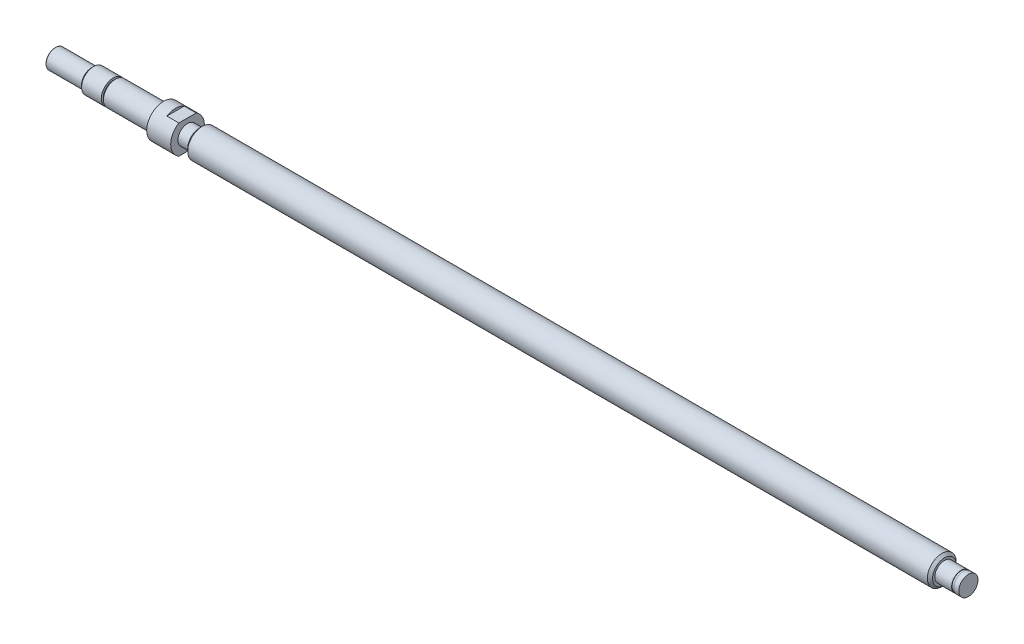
ISO-10303-21;
HEADER;
FILE_DESCRIPTION(('STEP AP214'),'2;1');
FILE_NAME('part.step','',(''),(''),'','','');
FILE_SCHEMA(('AUTOMOTIVE_DESIGN { 1 0 10303 214 1 1 1 1 }'));
ENDSEC;
DATA;
#1=APPLICATION_CONTEXT('core data for automotive mechanical design processes');
#2=APPLICATION_PROTOCOL_DEFINITION('international standard','automotive_design',2000,#1);
#3=PRODUCT_CONTEXT('',#1,'mechanical');
#4=PRODUCT('Part','Part','',(#3));
#5=PRODUCT_RELATED_PRODUCT_CATEGORY('part','',(#4));
#6=PRODUCT_DEFINITION_FORMATION('','',#4);
#7=PRODUCT_DEFINITION_CONTEXT('part definition',#1,'design');
#8=PRODUCT_DEFINITION('design','',#6,#7);
#9=PRODUCT_DEFINITION_SHAPE('','',#8);
#10=(LENGTH_UNIT() NAMED_UNIT(*) SI_UNIT(.MILLI.,.METRE.));
#11=(NAMED_UNIT(*) PLANE_ANGLE_UNIT() SI_UNIT($,.RADIAN.));
#12=(NAMED_UNIT(*) SI_UNIT($,.STERADIAN.) SOLID_ANGLE_UNIT());
#13=UNCERTAINTY_MEASURE_WITH_UNIT(LENGTH_MEASURE(1.E-05),#10,'distance_accuracy_value','');
#14=(GEOMETRIC_REPRESENTATION_CONTEXT(3) GLOBAL_UNCERTAINTY_ASSIGNED_CONTEXT((#13)) GLOBAL_UNIT_ASSIGNED_CONTEXT((#10,
#11,#12)) REPRESENTATION_CONTEXT('',''));
#15=CARTESIAN_POINT('',(0.,0.,0.));
#16=DIRECTION('',(0.,0.,1.));
#17=DIRECTION('',(1.,0.,0.));
#18=AXIS2_PLACEMENT_3D('',#15,#16,#17);
#19=CARTESIAN_POINT('',(-215.,3.84000000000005,0.));
#20=DIRECTION('',(1.,0.,0.));
#21=DIRECTION('',(0.,0.,-1.));
#22=AXIS2_PLACEMENT_3D('',#19,#20,#21);
#23=PLANE('',#22);
#24=CARTESIAN_POINT('',(-215.,0.,0.));
#25=DIRECTION('',(-1.,0.,0.));
#26=DIRECTION('',(0.,0.,1.));
#27=AXIS2_PLACEMENT_3D('',#24,#25,#26);
#28=CIRCLE('',#27,3.84000000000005);
#29=CARTESIAN_POINT('',(-215.,0.,3.84000000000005));
#30=VERTEX_POINT('',#29);
#31=EDGE_CURVE('E152',#30,#30,#28,.T.);
#32=ORIENTED_EDGE('',*,*,#31,.T.);
#33=EDGE_LOOP('',(#32));
#34=FACE_BOUND('',#33,.T.);
#35=ADVANCED_FACE('F15',(#34),#23,.F.);
#36=CARTESIAN_POINT('',(165.,0.,0.));
#37=DIRECTION('',(-1.,0.,0.));
#38=DIRECTION('',(0.,0.,1.));
#39=AXIS2_PLACEMENT_3D('',#36,#37,#38);
#40=PLANE('',#39);
#41=CARTESIAN_POINT('',(165.,0.,0.));
#42=DIRECTION('',(-1.,0.,0.));
#43=DIRECTION('',(0.,0.,1.));
#44=AXIS2_PLACEMENT_3D('',#41,#42,#43);
#45=CIRCLE('',#44,4.);
#46=CARTESIAN_POINT('',(165.,0.,4.));
#47=VERTEX_POINT('',#46);
#48=EDGE_CURVE('E133',#47,#47,#45,.T.);
#49=ORIENTED_EDGE('',*,*,#48,.F.);
#50=EDGE_LOOP('',(#49));
#51=FACE_BOUND('',#50,.T.);
#52=ADVANCED_FACE('F217',(#51),#40,.F.);
#53=CARTESIAN_POINT('',(-215.,0.,0.));
#54=DIRECTION('',(-1.,0.,0.));
#55=DIRECTION('',(0.,0.,1.));
#56=AXIS2_PLACEMENT_3D('',#53,#54,#55);
#57=CYLINDRICAL_SURFACE('',#56,4.);
#58=CARTESIAN_POINT('',(162.9,0.,0.));
#59=DIRECTION('',(-1.,0.,0.));
#60=DIRECTION('',(0.,0.,1.));
#61=AXIS2_PLACEMENT_3D('',#58,#59,#60);
#62=CIRCLE('',#61,4.);
#63=CARTESIAN_POINT('',(162.9,0.,4.));
#64=VERTEX_POINT('',#63);
#65=EDGE_CURVE('E129',#64,#64,#62,.T.);
#66=ORIENTED_EDGE('',*,*,#65,.F.);
#67=EDGE_LOOP('',(#66));
#68=FACE_BOUND('',#67,.T.);
#69=ORIENTED_EDGE('',*,*,#48,.T.);
#70=EDGE_LOOP('',(#69));
#71=FACE_BOUND('',#70,.T.);
#72=ADVANCED_FACE('F222',(#68,#71),#57,.T.);
#73=CARTESIAN_POINT('',(162.9,4.,0.));
#74=DIRECTION('',(1.,0.,0.));
#75=DIRECTION('',(0.,0.,-1.));
#76=AXIS2_PLACEMENT_3D('',#73,#74,#75);
#77=PLANE('',#76);
#78=CARTESIAN_POINT('',(162.9,0.,0.));
#79=DIRECTION('',(-1.,0.,0.));
#80=DIRECTION('',(0.,0.,1.));
#81=AXIS2_PLACEMENT_3D('',#78,#79,#80);
#82=CIRCLE('',#81,3.8);
#83=CARTESIAN_POINT('',(162.9,0.,3.8));
#84=VERTEX_POINT('',#83);
#85=EDGE_CURVE('E125',#84,#84,#82,.T.);
#86=ORIENTED_EDGE('',*,*,#85,.F.);
#87=EDGE_LOOP('',(#86));
#88=FACE_BOUND('',#87,.T.);
#89=ORIENTED_EDGE('',*,*,#65,.T.);
#90=EDGE_LOOP('',(#89));
#91=FACE_BOUND('',#90,.T.);
#92=ADVANCED_FACE('F467',(#88,#91),#77,.F.);
#93=CARTESIAN_POINT('',(-215.,0.,0.));
#94=DIRECTION('',(-1.,0.,0.));
#95=DIRECTION('',(0.,0.,1.));
#96=AXIS2_PLACEMENT_3D('',#93,#94,#95);
#97=CYLINDRICAL_SURFACE('',#96,3.8);
#98=CARTESIAN_POINT('',(162.,0.,0.));
#99=DIRECTION('',(-1.,0.,0.));
#100=DIRECTION('',(0.,0.,1.));
#101=AXIS2_PLACEMENT_3D('',#98,#99,#100);
#102=CIRCLE('',#101,3.8);
#103=CARTESIAN_POINT('',(162.,0.,3.8));
#104=VERTEX_POINT('',#103);
#105=EDGE_CURVE('E121',#104,#104,#102,.T.);
#106=ORIENTED_EDGE('',*,*,#105,.F.);
#107=EDGE_LOOP('',(#106));
#108=FACE_BOUND('',#107,.T.);
#109=ORIENTED_EDGE('',*,*,#85,.T.);
#110=EDGE_LOOP('',(#109));
#111=FACE_BOUND('',#110,.T.);
#112=ADVANCED_FACE('F457',(#108,#111),#97,.T.);
#113=CARTESIAN_POINT('',(162.,3.8,0.));
#114=DIRECTION('',(-1.,0.,0.));
#115=DIRECTION('',(0.,0.,1.));
#116=AXIS2_PLACEMENT_3D('',#113,#114,#115);
#117=PLANE('',#116);
#118=CARTESIAN_POINT('',(162.,0.,0.));
#119=DIRECTION('',(-1.,0.,0.));
#120=DIRECTION('',(0.,0.,1.));
#121=AXIS2_PLACEMENT_3D('',#118,#119,#120);
#122=CIRCLE('',#121,4.);
#123=CARTESIAN_POINT('',(162.,0.,4.));
#124=VERTEX_POINT('',#123);
#125=EDGE_CURVE('E117',#124,#124,#122,.T.);
#126=ORIENTED_EDGE('',*,*,#125,.F.);
#127=EDGE_LOOP('',(#126));
#128=FACE_BOUND('',#127,.T.);
#129=ORIENTED_EDGE('',*,*,#105,.T.);
#130=EDGE_LOOP('',(#129));
#131=FACE_BOUND('',#130,.T.);
#132=ADVANCED_FACE('F447',(#128,#131),#117,.F.);
#133=CARTESIAN_POINT('',(-215.,0.,0.));
#134=DIRECTION('',(-1.,0.,0.));
#135=DIRECTION('',(0.,0.,1.));
#136=AXIS2_PLACEMENT_3D('',#133,#134,#135);
#137=CYLINDRICAL_SURFACE('',#136,4.);
#138=CARTESIAN_POINT('',(155.,0.,0.));
#139=DIRECTION('',(-1.,0.,0.));
#140=DIRECTION('',(0.,0.,1.));
#141=AXIS2_PLACEMENT_3D('',#138,#139,#140);
#142=CIRCLE('',#141,4.);
#143=CARTESIAN_POINT('',(155.,0.,4.));
#144=VERTEX_POINT('',#143);
#145=EDGE_CURVE('E113',#144,#144,#142,.T.);
#146=ORIENTED_EDGE('',*,*,#145,.F.);
#147=EDGE_LOOP('',(#146));
#148=FACE_BOUND('',#147,.T.);
#149=ORIENTED_EDGE('',*,*,#125,.T.);
#150=EDGE_LOOP('',(#149));
#151=FACE_BOUND('',#150,.T.);
#152=ADVANCED_FACE('F437',(#148,#151),#137,.T.);
#153=CARTESIAN_POINT('',(155.,4.9175,0.));
#154=DIRECTION('',(1.,0.,0.));
#155=DIRECTION('',(0.,0.,-1.));
#156=AXIS2_PLACEMENT_3D('',#153,#154,#155);
#157=PLANE('',#156);
#158=ORIENTED_EDGE('',*,*,#145,.T.);
#159=EDGE_LOOP('',(#158));
#160=FACE_BOUND('',#159,.T.);
#161=CARTESIAN_POINT('',(155.,0.,0.));
#162=DIRECTION('',(-1.,0.,0.));
#163=DIRECTION('',(0.,0.,1.));
#164=AXIS2_PLACEMENT_3D('',#161,#162,#163);
#165=CIRCLE('',#164,4.9175);
#166=CARTESIAN_POINT('',(155.,0.,4.9175));
#167=VERTEX_POINT('',#166);
#168=EDGE_CURVE('E109',#167,#167,#165,.T.);
#169=ORIENTED_EDGE('',*,*,#168,.F.);
#170=EDGE_LOOP('',(#169));
#171=FACE_BOUND('',#170,.T.);
#172=ADVANCED_FACE('F427',(#160,#171),#157,.T.);
#173=CARTESIAN_POINT('',(155.,0.,0.));
#174=DIRECTION('',(-1.,0.,0.));
#175=DIRECTION('',(0.,0.,1.));
#176=AXIS2_PLACEMENT_3D('',#173,#174,#175);
#177=CONICAL_SURFACE('',#176,4.9175,0.785398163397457);
#178=CARTESIAN_POINT('',(153.9175,0.,0.));
#179=DIRECTION('',(-1.,0.,0.));
#180=DIRECTION('',(0.,0.,1.));
#181=AXIS2_PLACEMENT_3D('',#178,#179,#180);
#182=CIRCLE('',#181,6.);
#183=CARTESIAN_POINT('',(153.9175,0.,6.));
#184=VERTEX_POINT('',#183);
#185=EDGE_CURVE('E105',#184,#184,#182,.T.);
#186=ORIENTED_EDGE('',*,*,#185,.F.);
#187=EDGE_LOOP('',(#186));
#188=FACE_BOUND('',#187,.T.);
#189=ORIENTED_EDGE('',*,*,#168,.T.);
#190=EDGE_LOOP('',(#189));
#191=FACE_BOUND('',#190,.T.);
#192=ADVANCED_FACE('F417',(#188,#191),#177,.T.);
#193=CARTESIAN_POINT('',(-215.,0.,0.));
#194=DIRECTION('',(-1.,0.,0.));
#195=DIRECTION('',(0.,0.,1.));
#196=AXIS2_PLACEMENT_3D('',#193,#194,#195);
#197=CYLINDRICAL_SURFACE('',#196,6.);
#198=CARTESIAN_POINT('',(-153.9175,0.,0.));
#199=DIRECTION('',(-1.,0.,0.));
#200=DIRECTION('',(0.,0.,1.));
#201=AXIS2_PLACEMENT_3D('',#198,#199,#200);
#202=CIRCLE('',#201,6.);
#203=CARTESIAN_POINT('',(-153.9175,0.,6.));
#204=VERTEX_POINT('',#203);
#205=EDGE_CURVE('E101',#204,#204,#202,.T.);
#206=ORIENTED_EDGE('',*,*,#205,.F.);
#207=EDGE_LOOP('',(#206));
#208=FACE_BOUND('',#207,.T.);
#209=ORIENTED_EDGE('',*,*,#185,.T.);
#210=EDGE_LOOP('',(#209));
#211=FACE_BOUND('',#210,.T.);
#212=ADVANCED_FACE('F407',(#208,#211),#197,.T.);
#213=CARTESIAN_POINT('',(-155.,0.,0.));
#214=DIRECTION('',(1.,0.,0.));
#215=DIRECTION('',(0.,0.,-1.));
#216=AXIS2_PLACEMENT_3D('',#213,#214,#215);
#217=CONICAL_SURFACE('',#216,4.9175,0.785398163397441);
#218=ORIENTED_EDGE('',*,*,#205,.T.);
#219=EDGE_LOOP('',(#218));
#220=FACE_BOUND('',#219,.T.);
#221=CARTESIAN_POINT('',(-155.,0.,0.));
#222=DIRECTION('',(-1.,0.,0.));
#223=DIRECTION('',(0.,0.,1.));
#224=AXIS2_PLACEMENT_3D('',#221,#222,#223);
#225=CIRCLE('',#224,4.9175);
#226=CARTESIAN_POINT('',(-155.,0.,4.9175));
#227=VERTEX_POINT('',#226);
#228=EDGE_CURVE('E97',#227,#227,#225,.T.);
#229=ORIENTED_EDGE('',*,*,#228,.F.);
#230=EDGE_LOOP('',(#229));
#231=FACE_BOUND('',#230,.T.);
#232=ADVANCED_FACE('F397',(#220,#231),#217,.T.);
#233=CARTESIAN_POINT('',(-155.,4.9175,0.));
#234=DIRECTION('',(1.,0.,0.));
#235=DIRECTION('',(0.,0.,-1.));
#236=AXIS2_PLACEMENT_3D('',#233,#234,#235);
#237=PLANE('',#236);
#238=CARTESIAN_POINT('',(-155.,0.,0.));
#239=DIRECTION('',(-1.,0.,0.));
#240=DIRECTION('',(0.,0.,1.));
#241=AXIS2_PLACEMENT_3D('',#238,#239,#240);
#242=CIRCLE('',#241,4.);
#243=CARTESIAN_POINT('',(-155.,0.,4.));
#244=VERTEX_POINT('',#243);
#245=EDGE_CURVE('E87',#244,#244,#242,.T.);
#246=ORIENTED_EDGE('',*,*,#245,.F.);
#247=EDGE_LOOP('',(#246));
#248=FACE_BOUND('',#247,.T.);
#249=ORIENTED_EDGE('',*,*,#228,.T.);
#250=EDGE_LOOP('',(#249));
#251=FACE_BOUND('',#250,.T.);
#252=ADVANCED_FACE('F387',(#248,#251),#237,.F.);
#253=CARTESIAN_POINT('',(-215.,0.,0.));
#254=DIRECTION('',(-1.,0.,0.));
#255=DIRECTION('',(0.,0.,1.));
#256=AXIS2_PLACEMENT_3D('',#253,#254,#255);
#257=CYLINDRICAL_SURFACE('',#256,4.);
#258=CARTESIAN_POINT('',(-160.,0.,0.));
#259=DIRECTION('',(-1.,0.,0.));
#260=DIRECTION('',(0.,0.,1.));
#261=AXIS2_PLACEMENT_3D('',#258,#259,#260);
#262=CIRCLE('',#261,4.);
#263=CARTESIAN_POINT('',(-160.,0.,4.));
#264=VERTEX_POINT('',#263);
#265=EDGE_CURVE('E78',#264,#264,#262,.T.);
#266=ORIENTED_EDGE('',*,*,#265,.F.);
#267=EDGE_LOOP('',(#266));
#268=FACE_BOUND('',#267,.T.);
#269=ORIENTED_EDGE('',*,*,#245,.T.);
#270=EDGE_LOOP('',(#269));
#271=FACE_BOUND('',#270,.T.);
#272=ADVANCED_FACE('F214',(#268,#271),#257,.T.);
#273=CARTESIAN_POINT('',(-160.,4.,0.));
#274=DIRECTION('',(-1.,0.,0.));
#275=DIRECTION('',(0.,0.,1.));
#276=AXIS2_PLACEMENT_3D('',#273,#274,#275);
#277=PLANE('',#276);
#278=CARTESIAN_POINT('',(-160.,0.,0.));
#279=DIRECTION('',(-1.,0.,0.));
#280=DIRECTION('',(0.,0.,1.));
#281=AXIS2_PLACEMENT_3D('',#278,#279,#280);
#282=CIRCLE('',#281,7.);
#283=CARTESIAN_POINT('',(-160.,-6.,3.60555127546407));
#284=VERTEX_POINT('',#283);
#285=CARTESIAN_POINT('',(-160.,6.,3.60555127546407));
#286=VERTEX_POINT('',#285);
#287=EDGE_CURVE('E79',#284,#286,#282,.T.);
#288=ORIENTED_EDGE('',*,*,#287,.F.);
#289=DIRECTION('',(0.,0.,-1.));
#290=VECTOR('',#289,1.);
#291=CARTESIAN_POINT('',(-160.,-6.,0.));
#292=LINE('',#291,#290);
#293=CARTESIAN_POINT('',(-160.,-6.,-3.60555127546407));
#294=VERTEX_POINT('',#293);
#295=EDGE_CURVE('E65',#284,#294,#292,.T.);
#296=ORIENTED_EDGE('',*,*,#295,.T.);
#297=CARTESIAN_POINT('',(-160.,6.,-3.60555127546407));
#298=VERTEX_POINT('',#297);
#299=EDGE_CURVE('E72',#298,#294,#282,.T.);
#300=ORIENTED_EDGE('',*,*,#299,.F.);
#301=DIRECTION('',(0.,0.,1.));
#302=VECTOR('',#301,1.);
#303=CARTESIAN_POINT('',(-160.,6.,0.));
#304=LINE('',#303,#302);
#305=EDGE_CURVE('E150',#298,#286,#304,.T.);
#306=ORIENTED_EDGE('',*,*,#305,.T.);
#307=EDGE_LOOP('',(#288,#296,#300,#306));
#308=FACE_BOUND('',#307,.T.);
#309=ORIENTED_EDGE('',*,*,#265,.T.);
#310=EDGE_LOOP('',(#309));
#311=FACE_BOUND('',#310,.T.);
#312=ADVANCED_FACE('F148',(#308,#311),#277,.F.);
#313=CARTESIAN_POINT('',(-215.,0.,0.));
#314=DIRECTION('',(-1.,0.,0.));
#315=DIRECTION('',(0.,0.,1.));
#316=AXIS2_PLACEMENT_3D('',#313,#314,#315);
#317=CYLINDRICAL_SURFACE('',#316,7.);
#318=ORIENTED_EDGE('',*,*,#299,.T.);
#319=DIRECTION('',(-1.,0.,0.));
#320=VECTOR('',#319,1.);
#321=CARTESIAN_POINT('',(-215.,-6.,-3.60555127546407));
#322=LINE('',#321,#320);
#323=CARTESIAN_POINT('',(-165.,-6.,-3.60555127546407));
#324=VERTEX_POINT('',#323);
#325=EDGE_CURVE('E10',#294,#324,#322,.T.);
#326=ORIENTED_EDGE('',*,*,#325,.T.);
#327=CARTESIAN_POINT('',(-165.,0.,0.));
#328=DIRECTION('',(-1.,0.,0.));
#329=DIRECTION('',(0.,0.,1.));
#330=AXIS2_PLACEMENT_3D('',#327,#328,#329);
#331=CIRCLE('',#330,7.);
#332=CARTESIAN_POINT('',(-165.,-6.,3.60555127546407));
#333=VERTEX_POINT('',#332);
#334=EDGE_CURVE('E54',#324,#333,#331,.T.);
#335=ORIENTED_EDGE('',*,*,#334,.T.);
#336=DIRECTION('',(-1.,0.,0.));
#337=VECTOR('',#336,1.);
#338=CARTESIAN_POINT('',(-215.,-6.,3.60555127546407));
#339=LINE('',#338,#337);
#340=EDGE_CURVE('E23',#333,#284,#339,.F.);
#341=ORIENTED_EDGE('',*,*,#340,.T.);
#342=ORIENTED_EDGE('',*,*,#287,.T.);
#343=DIRECTION('',(-1.,0.,0.));
#344=VECTOR('',#343,1.);
#345=CARTESIAN_POINT('',(-215.,6.,3.60555127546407));
#346=LINE('',#345,#344);
#347=CARTESIAN_POINT('',(-165.,6.,3.60555127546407));
#348=VERTEX_POINT('',#347);
#349=EDGE_CURVE('E59',#286,#348,#346,.T.);
#350=ORIENTED_EDGE('',*,*,#349,.T.);
#351=CARTESIAN_POINT('',(-165.,0.,0.));
#352=DIRECTION('',(-1.,0.,0.));
#353=DIRECTION('',(0.,0.,1.));
#354=AXIS2_PLACEMENT_3D('',#351,#352,#353);
#355=CIRCLE('',#354,7.);
#356=CARTESIAN_POINT('',(-165.,6.,-3.60555127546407));
#357=VERTEX_POINT('',#356);
#358=EDGE_CURVE('E137',#348,#357,#355,.T.);
#359=ORIENTED_EDGE('',*,*,#358,.T.);
#360=DIRECTION('',(-1.,0.,0.));
#361=VECTOR('',#360,1.);
#362=CARTESIAN_POINT('',(-215.,6.,-3.60555127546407));
#363=LINE('',#362,#361);
#364=EDGE_CURVE('E74',#357,#298,#363,.F.);
#365=ORIENTED_EDGE('',*,*,#364,.T.);
#366=EDGE_LOOP('',(#318,#326,#335,#341,#342,#350,#359,#365));
#367=FACE_BOUND('',#366,.T.);
#368=CARTESIAN_POINT('',(-170.,0.,0.));
#369=DIRECTION('',(-1.,0.,0.));
#370=DIRECTION('',(0.,0.,1.));
#371=AXIS2_PLACEMENT_3D('',#368,#369,#370);
#372=CIRCLE('',#371,7.);
#373=CARTESIAN_POINT('',(-170.,0.,7.));
#374=VERTEX_POINT('',#373);
#375=EDGE_CURVE('E90',#374,#374,#372,.T.);
#376=ORIENTED_EDGE('',*,*,#375,.F.);
#377=EDGE_LOOP('',(#376));
#378=FACE_BOUND('',#377,.T.);
#379=ADVANCED_FACE('F68',(#367,#378),#317,.T.);
#380=CARTESIAN_POINT('',(-170.,7.,0.));
#381=DIRECTION('',(1.,0.,0.));
#382=DIRECTION('',(0.,0.,-1.));
#383=AXIS2_PLACEMENT_3D('',#380,#381,#382);
#384=PLANE('',#383);
#385=CARTESIAN_POINT('',(-170.,0.,0.));
#386=DIRECTION('',(-1.,0.,0.));
#387=DIRECTION('',(0.,0.,1.));
#388=AXIS2_PLACEMENT_3D('',#385,#386,#387);
#389=CIRCLE('',#388,5.);
#390=CARTESIAN_POINT('',(-170.,0.,5.));
#391=VERTEX_POINT('',#390);
#392=EDGE_CURVE('E190',#391,#391,#389,.T.);
#393=ORIENTED_EDGE('',*,*,#392,.F.);
#394=EDGE_LOOP('',(#393));
#395=FACE_BOUND('',#394,.T.);
#396=ORIENTED_EDGE('',*,*,#375,.T.);
#397=EDGE_LOOP('',(#396));
#398=FACE_BOUND('',#397,.T.);
#399=ADVANCED_FACE('F203',(#395,#398),#384,.F.);
#400=CARTESIAN_POINT('',(-215.,0.,0.));
#401=DIRECTION('',(-1.,0.,0.));
#402=DIRECTION('',(0.,0.,1.));
#403=AXIS2_PLACEMENT_3D('',#400,#401,#402);
#404=CYLINDRICAL_SURFACE('',#403,5.);
#405=CARTESIAN_POINT('',(-190.,0.,0.));
#406=DIRECTION('',(-1.,0.,0.));
#407=DIRECTION('',(0.,0.,1.));
#408=AXIS2_PLACEMENT_3D('',#405,#406,#407);
#409=CIRCLE('',#408,5.);
#410=CARTESIAN_POINT('',(-190.,0.,5.));
#411=VERTEX_POINT('',#410);
#412=EDGE_CURVE('E187',#411,#411,#409,.T.);
#413=ORIENTED_EDGE('',*,*,#412,.F.);
#414=EDGE_LOOP('',(#413));
#415=FACE_BOUND('',#414,.T.);
#416=ORIENTED_EDGE('',*,*,#392,.T.);
#417=EDGE_LOOP('',(#416));
#418=FACE_BOUND('',#417,.T.);
#419=ADVANCED_FACE('F211',(#415,#418),#404,.T.);
#420=CARTESIAN_POINT('',(-190.90125,0.,0.));
#421=DIRECTION('',(1.,0.,0.));
#422=DIRECTION('',(0.,0.,-1.));
#423=AXIS2_PLACEMENT_3D('',#420,#421,#422);
#424=CONICAL_SURFACE('',#423,4.09875000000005,0.785398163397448);
#425=ORIENTED_EDGE('',*,*,#412,.T.);
#426=EDGE_LOOP('',(#425));
#427=FACE_BOUND('',#426,.T.);
#428=CARTESIAN_POINT('',(-190.90125,0.,0.));
#429=DIRECTION('',(-1.,0.,0.));
#430=DIRECTION('',(0.,0.,1.));
#431=AXIS2_PLACEMENT_3D('',#428,#429,#430);
#432=CIRCLE('',#431,4.09875000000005);
#433=CARTESIAN_POINT('',(-190.90125,0.,4.09875000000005));
#434=VERTEX_POINT('',#433);
#435=EDGE_CURVE('E183',#434,#434,#432,.T.);
#436=ORIENTED_EDGE('',*,*,#435,.F.);
#437=EDGE_LOOP('',(#436));
#438=FACE_BOUND('',#437,.T.);
#439=ADVANCED_FACE('F259',(#427,#438),#424,.T.);
#440=CARTESIAN_POINT('',(-190.90125,5.,0.));
#441=DIRECTION('',(1.,0.,0.));
#442=DIRECTION('',(0.,0.,-1.));
#443=AXIS2_PLACEMENT_3D('',#440,#441,#442);
#444=PLANE('',#443);
#445=ORIENTED_EDGE('',*,*,#435,.T.);
#446=EDGE_LOOP('',(#445));
#447=FACE_BOUND('',#446,.T.);
#448=CARTESIAN_POINT('',(-190.90125,0.,0.));
#449=DIRECTION('',(-1.,0.,0.));
#450=DIRECTION('',(0.,0.,1.));
#451=AXIS2_PLACEMENT_3D('',#448,#449,#450);
#452=CIRCLE('',#451,5.);
#453=CARTESIAN_POINT('',(-190.90125,0.,5.));
#454=VERTEX_POINT('',#453);
#455=EDGE_CURVE('E179',#454,#454,#452,.T.);
#456=ORIENTED_EDGE('',*,*,#455,.F.);
#457=EDGE_LOOP('',(#456));
#458=FACE_BOUND('',#457,.T.);
#459=ADVANCED_FACE('F254',(#447,#458),#444,.T.);
#460=CARTESIAN_POINT('',(-215.,0.,0.));
#461=DIRECTION('',(-1.,0.,0.));
#462=DIRECTION('',(0.,0.,1.));
#463=AXIS2_PLACEMENT_3D('',#460,#461,#462);
#464=CYLINDRICAL_SURFACE('',#463,5.);
#465=CARTESIAN_POINT('',(-199.09875,0.,0.));
#466=DIRECTION('',(-1.,0.,0.));
#467=DIRECTION('',(0.,0.,1.));
#468=AXIS2_PLACEMENT_3D('',#465,#466,#467);
#469=CIRCLE('',#468,5.);
#470=CARTESIAN_POINT('',(-199.09875,0.,5.));
#471=VERTEX_POINT('',#470);
#472=EDGE_CURVE('E175',#471,#471,#469,.T.);
#473=ORIENTED_EDGE('',*,*,#472,.F.);
#474=EDGE_LOOP('',(#473));
#475=FACE_BOUND('',#474,.T.);
#476=ORIENTED_EDGE('',*,*,#455,.T.);
#477=EDGE_LOOP('',(#476));
#478=FACE_BOUND('',#477,.T.);
#479=ADVANCED_FACE('F248',(#475,#478),#464,.T.);
#480=CARTESIAN_POINT('',(-199.09875,0.,0.));
#481=DIRECTION('',(1.,0.,0.));
#482=DIRECTION('',(0.,0.,-1.));
#483=AXIS2_PLACEMENT_3D('',#480,#481,#482);
#484=CONICAL_SURFACE('',#483,5.,0.785398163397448);
#485=CARTESIAN_POINT('',(-200.,0.,0.));
#486=DIRECTION('',(-1.,0.,0.));
#487=DIRECTION('',(0.,0.,1.));
#488=AXIS2_PLACEMENT_3D('',#485,#486,#487);
#489=CIRCLE('',#488,4.09875000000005);
#490=CARTESIAN_POINT('',(-200.,0.,4.09875000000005));
#491=VERTEX_POINT('',#490);
#492=EDGE_CURVE('E171',#491,#491,#489,.T.);
#493=ORIENTED_EDGE('',*,*,#492,.F.);
#494=EDGE_LOOP('',(#493));
#495=FACE_BOUND('',#494,.T.);
#496=ORIENTED_EDGE('',*,*,#472,.T.);
#497=EDGE_LOOP('',(#496));
#498=FACE_BOUND('',#497,.T.);
#499=ADVANCED_FACE('F242',(#495,#498),#484,.T.);
#500=CARTESIAN_POINT('',(-200.,4.09875000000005,0.));
#501=DIRECTION('',(1.,0.,0.));
#502=DIRECTION('',(0.,0.,-1.));
#503=AXIS2_PLACEMENT_3D('',#500,#501,#502);
#504=PLANE('',#503);
#505=CARTESIAN_POINT('',(-200.,0.,0.));
#506=DIRECTION('',(-1.,0.,0.));
#507=DIRECTION('',(0.,0.,1.));
#508=AXIS2_PLACEMENT_3D('',#505,#506,#507);
#509=CIRCLE('',#508,4.00000000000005);
#510=CARTESIAN_POINT('',(-200.,0.,4.00000000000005));
#511=VERTEX_POINT('',#510);
#512=EDGE_CURVE('E167',#511,#511,#509,.T.);
#513=ORIENTED_EDGE('',*,*,#512,.F.);
#514=EDGE_LOOP('',(#513));
#515=FACE_BOUND('',#514,.T.);
#516=ORIENTED_EDGE('',*,*,#492,.T.);
#517=EDGE_LOOP('',(#516));
#518=FACE_BOUND('',#517,.T.);
#519=ADVANCED_FACE('F236',(#515,#518),#504,.F.);
#520=CARTESIAN_POINT('',(-215.,0.,0.));
#521=DIRECTION('',(-1.,0.,0.));
#522=DIRECTION('',(0.,0.,1.));
#523=AXIS2_PLACEMENT_3D('',#520,#521,#522);
#524=CYLINDRICAL_SURFACE('',#523,4.00000000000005);
#525=CARTESIAN_POINT('',(-214.84,0.,0.));
#526=DIRECTION('',(-1.,0.,0.));
#527=DIRECTION('',(0.,0.,1.));
#528=AXIS2_PLACEMENT_3D('',#525,#526,#527);
#529=CIRCLE('',#528,4.00000000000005);
#530=CARTESIAN_POINT('',(-214.84,0.,4.00000000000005));
#531=VERTEX_POINT('',#530);
#532=EDGE_CURVE('E158',#531,#531,#529,.T.);
#533=ORIENTED_EDGE('',*,*,#532,.F.);
#534=EDGE_LOOP('',(#533));
#535=FACE_BOUND('',#534,.T.);
#536=ORIENTED_EDGE('',*,*,#512,.T.);
#537=EDGE_LOOP('',(#536));
#538=FACE_BOUND('',#537,.T.);
#539=ADVANCED_FACE('F230',(#535,#538),#524,.T.);
#540=CARTESIAN_POINT('',(-214.84,0.,0.));
#541=DIRECTION('',(-1.,0.,0.));
#542=DIRECTION('',(0.,0.,1.));
#543=AXIS2_PLACEMENT_3D('',#540,#541,#542);
#544=TOROIDAL_SURFACE('',#543,3.84000000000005,0.16);
#545=ORIENTED_EDGE('',*,*,#31,.F.);
#546=EDGE_LOOP('',(#545));
#547=FACE_BOUND('',#546,.T.);
#548=ORIENTED_EDGE('',*,*,#532,.T.);
#549=EDGE_LOOP('',(#548));
#550=FACE_BOUND('',#549,.T.);
#551=ADVANCED_FACE('F226',(#547,#550),#544,.T.);
#552=CARTESIAN_POINT('',(-162.,6.,-14.));
#553=DIRECTION('',(0.,-1.,0.));
#554=DIRECTION('',(0.,0.,-1.));
#555=AXIS2_PLACEMENT_3D('',#552,#553,#554);
#556=PLANE('',#555);
#557=ORIENTED_EDGE('',*,*,#305,.F.);
#558=ORIENTED_EDGE('',*,*,#364,.F.);
#559=DIRECTION('',(0.,0.,1.));
#560=VECTOR('',#559,1.);
#561=CARTESIAN_POINT('',(-165.,6.,-14.));
#562=LINE('',#561,#560);
#563=EDGE_CURVE('E36',#357,#348,#562,.T.);
#564=ORIENTED_EDGE('',*,*,#563,.T.);
#565=ORIENTED_EDGE('',*,*,#349,.F.);
#566=EDGE_LOOP('',(#557,#558,#564,#565));
#567=FACE_BOUND('',#566,.T.);
#568=ADVANCED_FACE('F229',(#567),#556,.F.);
#569=CARTESIAN_POINT('',(-165.,12.,-14.));
#570=DIRECTION('',(-1.,0.,0.));
#571=DIRECTION('',(0.,0.,1.));
#572=AXIS2_PLACEMENT_3D('',#569,#570,#571);
#573=PLANE('',#572);
#574=ORIENTED_EDGE('',*,*,#563,.F.);
#575=ORIENTED_EDGE('',*,*,#358,.F.);
#576=EDGE_LOOP('',(#574,#575));
#577=FACE_BOUND('',#576,.T.);
#578=ADVANCED_FACE('F330',(#577),#573,.F.);
#579=CARTESIAN_POINT('',(-162.,-6.,14.));
#580=DIRECTION('',(0.,1.,0.));
#581=DIRECTION('',(0.,0.,1.));
#582=AXIS2_PLACEMENT_3D('',#579,#580,#581);
#583=PLANE('',#582);
#584=ORIENTED_EDGE('',*,*,#295,.F.);
#585=ORIENTED_EDGE('',*,*,#340,.F.);
#586=DIRECTION('',(0.,0.,-1.));
#587=VECTOR('',#586,1.);
#588=CARTESIAN_POINT('',(-165.,-6.,14.));
#589=LINE('',#588,#587);
#590=EDGE_CURVE('E29',#333,#324,#589,.T.);
#591=ORIENTED_EDGE('',*,*,#590,.T.);
#592=ORIENTED_EDGE('',*,*,#325,.F.);
#593=EDGE_LOOP('',(#584,#585,#591,#592));
#594=FACE_BOUND('',#593,.T.);
#595=ADVANCED_FACE('F62',(#594),#583,.F.);
#596=CARTESIAN_POINT('',(-165.,-12.,14.));
#597=DIRECTION('',(-1.,0.,0.));
#598=DIRECTION('',(0.,0.,-1.));
#599=AXIS2_PLACEMENT_3D('',#596,#597,#598);
#600=PLANE('',#599);
#601=ORIENTED_EDGE('',*,*,#590,.F.);
#602=ORIENTED_EDGE('',*,*,#334,.F.);
#603=EDGE_LOOP('',(#601,#602));
#604=FACE_BOUND('',#603,.T.);
#605=ADVANCED_FACE('F55',(#604),#600,.F.);
#606=CLOSED_SHELL('',(#35,#52,#72,#92,#112,#132,#152,#172,#192,#212,#232,#252,#272,#312,#379,
#399,#419,#439,#459,#479,#499,#519,#539,#551,#568,#578,#595,#605));
#607=MANIFOLD_SOLID_BREP('B1',#606);
#608=ADVANCED_BREP_SHAPE_REPRESENTATION('',(#18,#607),#14);
#609=SHAPE_DEFINITION_REPRESENTATION(#9,#608);
ENDSEC;
END-ISO-10303-21;
